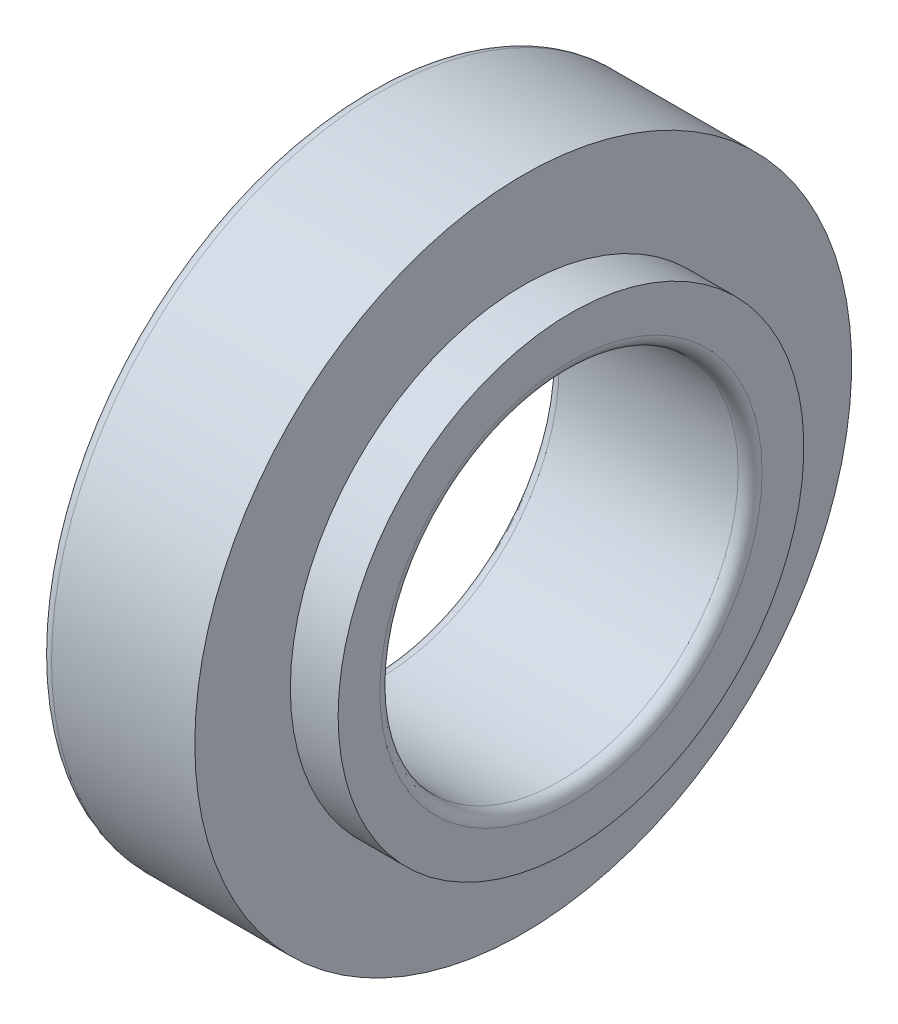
from build123d import *


with BuildPart() as part:
    # Sketch1 → Revolve1 (revolve)
    with BuildSketch(Plane.XY, mode=Mode.PRIVATE) as revolve1_sk:
        with BuildLine():
            Line((1, 27.5), (13, 27.5))
            Line((13, 27.5), (13, 19.5))
            Line((13, 19.5), (17, 19.5))
            Line((17, 19.5), (17, 16))
            ThreePointArc((17, 16), (16.707106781, 15.292893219), (16, 15))
            Line((16, 15), (1, 15))
            ThreePointArc((1, 15), (0.292893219, 15.292893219), (0, 16))
            Line((0, 16), (0, 17.5))
            Line((0, 17.5), (4, 17.5))
            Line((4, 17.5), (4, 24))
            Line((4, 24), (0, 24))
            Line((0, 24), (0, 26.5))
            ThreePointArc((0, 26.5), (0.292893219, 27.207106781), (1, 27.5))
        make_face()
    revolve(revolve1_sk.sketch.rotate(Axis((0, 0, 0), (1, 0, 0)), 90), axis=Axis((0, 0, 0), (1, 0, 0)))


solid = part.part
